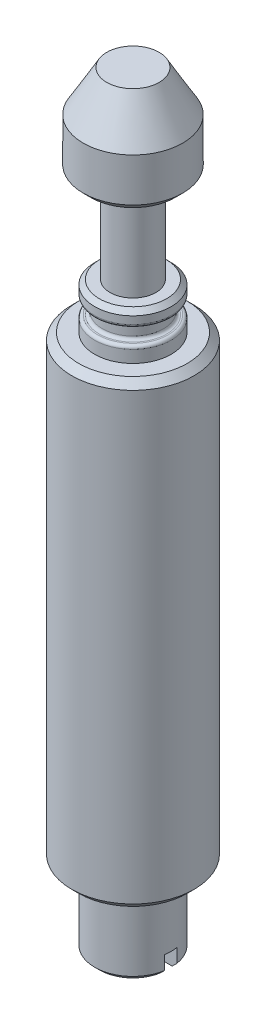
ISO-10303-21;
HEADER;
FILE_DESCRIPTION(('STEP AP214'),'2;1');
FILE_NAME('part.step','',(''),(''),'','','');
FILE_SCHEMA(('AUTOMOTIVE_DESIGN { 1 0 10303 214 1 1 1 1 }'));
ENDSEC;
DATA;
#1=APPLICATION_CONTEXT('core data for automotive mechanical design processes');
#2=APPLICATION_PROTOCOL_DEFINITION('international standard','automotive_design',2000,#1);
#3=PRODUCT_CONTEXT('',#1,'mechanical');
#4=PRODUCT('Part','Part','',(#3));
#5=PRODUCT_RELATED_PRODUCT_CATEGORY('part','',(#4));
#6=PRODUCT_DEFINITION_FORMATION('','',#4);
#7=PRODUCT_DEFINITION_CONTEXT('part definition',#1,'design');
#8=PRODUCT_DEFINITION('design','',#6,#7);
#9=PRODUCT_DEFINITION_SHAPE('','',#8);
#10=(LENGTH_UNIT() NAMED_UNIT(*) SI_UNIT(.MILLI.,.METRE.));
#11=(NAMED_UNIT(*) PLANE_ANGLE_UNIT() SI_UNIT($,.RADIAN.));
#12=(NAMED_UNIT(*) SI_UNIT($,.STERADIAN.) SOLID_ANGLE_UNIT());
#13=UNCERTAINTY_MEASURE_WITH_UNIT(LENGTH_MEASURE(1.E-05),#10,'distance_accuracy_value','');
#14=(GEOMETRIC_REPRESENTATION_CONTEXT(3) GLOBAL_UNCERTAINTY_ASSIGNED_CONTEXT((#13)) GLOBAL_UNIT_ASSIGNED_CONTEXT((#10,
#11,#12)) REPRESENTATION_CONTEXT('',''));
#15=CARTESIAN_POINT('',(0.,0.,0.));
#16=DIRECTION('',(0.,0.,1.));
#17=DIRECTION('',(1.,0.,0.));
#18=AXIS2_PLACEMENT_3D('',#15,#16,#17);
#19=CARTESIAN_POINT('',(0.,50.,0.));
#20=DIRECTION('',(0.,-1.,0.));
#21=DIRECTION('',(0.,0.,-1.));
#22=AXIS2_PLACEMENT_3D('',#19,#20,#21);
#23=PLANE('',#22);
#24=CARTESIAN_POINT('',(0.,49.9999999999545,0.));
#25=DIRECTION('',(0.,-1.,0.));
#26=DIRECTION('',(0.,0.,-1.));
#27=AXIS2_PLACEMENT_3D('',#24,#25,#26);
#28=CIRCLE('',#27,1.71039929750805);
#29=CARTESIAN_POINT('',(0.,49.9999999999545,-1.71039929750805));
#30=VERTEX_POINT('',#29);
#31=EDGE_CURVE('E508',#30,#30,#28,.T.);
#32=ORIENTED_EDGE('',*,*,#31,.F.);
#33=EDGE_LOOP('',(#32));
#34=FACE_BOUND('',#33,.T.);
#35=ADVANCED_FACE('F17',(#34),#23,.F.);
#36=CARTESIAN_POINT('',(0.,47.3333333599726,0.));
#37=DIRECTION('',(0.,-1.,0.));
#38=DIRECTION('',(0.,0.,-1.));
#39=AXIS2_PLACEMENT_3D('',#36,#37,#38);
#40=CONICAL_SURFACE('',#39,3.24999999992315,0.523598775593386);
#41=CARTESIAN_POINT('',(0.,47.33333336,0.));
#42=DIRECTION('',(0.,1.,0.));
#43=DIRECTION('',(0.,0.,1.));
#44=AXIS2_PLACEMENT_3D('',#41,#42,#43);
#45=CIRCLE('',#44,3.25);
#46=CARTESIAN_POINT('',(0.,47.33333336,3.25));
#47=VERTEX_POINT('',#46);
#48=EDGE_CURVE('E511',#47,#47,#45,.F.);
#49=ORIENTED_EDGE('',*,*,#48,.F.);
#50=EDGE_LOOP('',(#49));
#51=FACE_BOUND('',#50,.T.);
#52=ORIENTED_EDGE('',*,*,#31,.T.);
#53=EDGE_LOOP('',(#52));
#54=FACE_BOUND('',#53,.T.);
#55=ADVANCED_FACE('F1092',(#51,#54),#40,.T.);
#56=CARTESIAN_POINT('',(0.,0.,0.));
#57=DIRECTION('',(0.,1.,0.));
#58=DIRECTION('',(0.,0.,1.));
#59=AXIS2_PLACEMENT_3D('',#56,#57,#58);
#60=CYLINDRICAL_SURFACE('',#59,3.25);
#61=ORIENTED_EDGE('',*,*,#48,.T.);
#62=EDGE_LOOP('',(#61));
#63=FACE_BOUND('',#62,.T.);
#64=CARTESIAN_POINT('',(0.,44.4999999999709,0.));
#65=DIRECTION('',(0.,1.,0.));
#66=DIRECTION('',(0.,0.,1.));
#67=AXIS2_PLACEMENT_3D('',#64,#65,#66);
#68=CIRCLE('',#67,3.25000000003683);
#69=CARTESIAN_POINT('',(0.,44.4999999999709,3.25000000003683));
#70=VERTEX_POINT('',#69);
#71=EDGE_CURVE('E507',#70,#70,#68,.F.);
#72=ORIENTED_EDGE('',*,*,#71,.F.);
#73=EDGE_LOOP('',(#72));
#74=FACE_BOUND('',#73,.T.);
#75=ADVANCED_FACE('F1089',(#63,#74),#60,.T.);
#76=CARTESIAN_POINT('',(0.,44.4999999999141,0.));
#77=DIRECTION('',(0.,1.,0.));
#78=DIRECTION('',(0.,0.,1.));
#79=AXIS2_PLACEMENT_3D('',#76,#77,#78);
#80=CONICAL_SURFACE('',#79,3.24999999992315,0.785398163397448);
#81=ORIENTED_EDGE('',*,*,#71,.T.);
#82=EDGE_LOOP('',(#81));
#83=FACE_BOUND('',#82,.T.);
#84=CARTESIAN_POINT('',(0.,43.9999999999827,0.));
#85=DIRECTION('',(0.,1.,0.));
#86=DIRECTION('',(0.,0.,1.));
#87=AXIS2_PLACEMENT_3D('',#84,#85,#86);
#88=CIRCLE('',#87,2.74999999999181);
#89=CARTESIAN_POINT('',(0.,43.9999999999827,2.74999999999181));
#90=VERTEX_POINT('',#89);
#91=EDGE_CURVE('E504',#90,#90,#88,.T.);
#92=ORIENTED_EDGE('',*,*,#91,.T.);
#93=EDGE_LOOP('',(#92));
#94=FACE_BOUND('',#93,.T.);
#95=ADVANCED_FACE('F1085',(#83,#94),#80,.T.);
#96=CARTESIAN_POINT('',(2.75,44.,0.));
#97=DIRECTION('',(0.,1.,0.));
#98=DIRECTION('',(0.,0.,1.));
#99=AXIS2_PLACEMENT_3D('',#96,#97,#98);
#100=PLANE('',#99);
#101=CARTESIAN_POINT('',(0.,44.,0.));
#102=DIRECTION('',(0.,1.,0.));
#103=DIRECTION('',(0.,0.,1.));
#104=AXIS2_PLACEMENT_3D('',#101,#102,#103);
#105=CIRCLE('',#104,1.5);
#106=CARTESIAN_POINT('',(0.,44.,1.5));
#107=VERTEX_POINT('',#106);
#108=EDGE_CURVE('E501',#107,#107,#105,.F.);
#109=ORIENTED_EDGE('',*,*,#108,.F.);
#110=EDGE_LOOP('',(#109));
#111=FACE_BOUND('',#110,.T.);
#112=ORIENTED_EDGE('',*,*,#91,.F.);
#113=EDGE_LOOP('',(#112));
#114=FACE_BOUND('',#113,.T.);
#115=ADVANCED_FACE('F812',(#111,#114),#100,.F.);
#116=CARTESIAN_POINT('',(0.,0.,0.));
#117=DIRECTION('',(0.,1.,0.));
#118=DIRECTION('',(0.,0.,1.));
#119=AXIS2_PLACEMENT_3D('',#116,#117,#118);
#120=CYLINDRICAL_SURFACE('',#119,1.5);
#121=ORIENTED_EDGE('',*,*,#108,.T.);
#122=EDGE_LOOP('',(#121));
#123=FACE_BOUND('',#122,.T.);
#124=CARTESIAN_POINT('',(0.,38.,0.));
#125=DIRECTION('',(0.,1.,0.));
#126=DIRECTION('',(0.,0.,1.));
#127=AXIS2_PLACEMENT_3D('',#124,#125,#126);
#128=CIRCLE('',#127,1.5);
#129=CARTESIAN_POINT('',(0.,38.,1.5));
#130=VERTEX_POINT('',#129);
#131=EDGE_CURVE('E498',#130,#130,#128,.T.);
#132=ORIENTED_EDGE('',*,*,#131,.T.);
#133=EDGE_LOOP('',(#132));
#134=FACE_BOUND('',#133,.T.);
#135=ADVANCED_FACE('F806',(#123,#134),#120,.T.);
#136=CARTESIAN_POINT('',(1.5,38.,0.));
#137=DIRECTION('',(0.,-1.,0.));
#138=DIRECTION('',(0.,0.,-1.));
#139=AXIS2_PLACEMENT_3D('',#136,#137,#138);
#140=PLANE('',#139);
#141=CARTESIAN_POINT('',(0.,38.0000000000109,0.));
#142=DIRECTION('',(0.,-1.,0.));
#143=DIRECTION('',(0.,0.,-1.));
#144=AXIS2_PLACEMENT_3D('',#141,#142,#143);
#145=CIRCLE('',#144,2.20000000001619);
#146=CARTESIAN_POINT('',(0.,38.0000000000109,-2.20000000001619));
#147=VERTEX_POINT('',#146);
#148=EDGE_CURVE('E494',#147,#147,#145,.T.);
#149=ORIENTED_EDGE('',*,*,#148,.F.);
#150=EDGE_LOOP('',(#149));
#151=FACE_BOUND('',#150,.T.);
#152=ORIENTED_EDGE('',*,*,#131,.F.);
#153=EDGE_LOOP('',(#152));
#154=FACE_BOUND('',#153,.T.);
#155=ADVANCED_FACE('F811',(#151,#154),#140,.F.);
#156=CARTESIAN_POINT('',(0.,37.7000000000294,0.));
#157=DIRECTION('',(0.,-1.,0.));
#158=DIRECTION('',(0.,0.,-1.));
#159=AXIS2_PLACEMENT_3D('',#156,#157,#158);
#160=CONICAL_SURFACE('',#159,2.49999999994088,0.785398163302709);
#161=CARTESIAN_POINT('',(0.,37.7,0.));
#162=DIRECTION('',(0.,1.,0.));
#163=DIRECTION('',(0.,0.,1.));
#164=AXIS2_PLACEMENT_3D('',#161,#162,#163);
#165=CIRCLE('',#164,2.5);
#166=CARTESIAN_POINT('',(0.,37.7,2.5));
#167=VERTEX_POINT('',#166);
#168=EDGE_CURVE('E497',#167,#167,#165,.F.);
#169=ORIENTED_EDGE('',*,*,#168,.F.);
#170=EDGE_LOOP('',(#169));
#171=FACE_BOUND('',#170,.T.);
#172=ORIENTED_EDGE('',*,*,#148,.T.);
#173=EDGE_LOOP('',(#172));
#174=FACE_BOUND('',#173,.T.);
#175=ADVANCED_FACE('F854',(#171,#174),#160,.T.);
#176=CARTESIAN_POINT('',(0.,2.5,0.));
#177=DIRECTION('',(0.,1.,0.));
#178=DIRECTION('',(0.,0.,1.));
#179=AXIS2_PLACEMENT_3D('',#176,#177,#178);
#180=PLANE('',#179);
#181=DIRECTION('',(0.866025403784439,0.,-0.5));
#182=VECTOR('',#181,1.);
#183=CARTESIAN_POINT('',(0.,2.5,-0.75));
#184=LINE('',#183,#182);
#185=CARTESIAN_POINT('',(0.,2.5,-0.75));
#186=VERTEX_POINT('',#185);
#187=CARTESIAN_POINT('',(-0.649519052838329,2.5,-0.375));
#188=VERTEX_POINT('',#187);
#189=EDGE_CURVE('E654',#186,#188,#184,.F.);
#190=ORIENTED_EDGE('',*,*,#189,.F.);
#191=DIRECTION('',(0.866025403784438,0.,0.5));
#192=VECTOR('',#191,1.);
#193=CARTESIAN_POINT('',(0.64951905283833,2.5,-0.374999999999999));
#194=LINE('',#193,#192);
#195=CARTESIAN_POINT('',(0.649519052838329,2.5,-0.375));
#196=VERTEX_POINT('',#195);
#197=EDGE_CURVE('E644',#196,#186,#194,.F.);
#198=ORIENTED_EDGE('',*,*,#197,.F.);
#199=DIRECTION('',(0.,0.,1.));
#200=VECTOR('',#199,1.);
#201=CARTESIAN_POINT('',(0.649519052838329,2.5,0.375));
#202=LINE('',#201,#200);
#203=CARTESIAN_POINT('',(0.649519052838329,2.5,0.375));
#204=VERTEX_POINT('',#203);
#205=EDGE_CURVE('E672',#204,#196,#202,.F.);
#206=ORIENTED_EDGE('',*,*,#205,.F.);
#207=DIRECTION('',(-0.866025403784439,0.,0.5));
#208=VECTOR('',#207,1.);
#209=CARTESIAN_POINT('',(0.,2.5,0.75));
#210=LINE('',#209,#208);
#211=CARTESIAN_POINT('',(0.,2.5,0.75));
#212=VERTEX_POINT('',#211);
#213=EDGE_CURVE('E669',#212,#204,#210,.F.);
#214=ORIENTED_EDGE('',*,*,#213,.F.);
#215=DIRECTION('',(-0.866025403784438,0.,-0.5));
#216=VECTOR('',#215,1.);
#217=CARTESIAN_POINT('',(-0.64951905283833,2.5,0.374999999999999));
#218=LINE('',#217,#216);
#219=CARTESIAN_POINT('',(-0.649519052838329,2.5,0.374999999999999));
#220=VERTEX_POINT('',#219);
#221=EDGE_CURVE('E664',#220,#212,#218,.F.);
#222=ORIENTED_EDGE('',*,*,#221,.F.);
#223=DIRECTION('',(0.,0.,-1.));
#224=VECTOR('',#223,1.);
#225=CARTESIAN_POINT('',(-0.649519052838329,2.5,-0.375));
#226=LINE('',#225,#224);
#227=EDGE_CURVE('E659',#188,#220,#226,.F.);
#228=ORIENTED_EDGE('',*,*,#227,.F.);
#229=EDGE_LOOP('',(#190,#198,#206,#214,#222,#228));
#230=FACE_BOUND('',#229,.T.);
#231=ADVANCED_FACE('F864',(#230),#180,.F.);
#232=CARTESIAN_POINT('',(0.,0.,0.));
#233=DIRECTION('',(0.,1.,0.));
#234=DIRECTION('',(0.,0.,1.));
#235=AXIS2_PLACEMENT_3D('',#232,#233,#234);
#236=CYLINDRICAL_SURFACE('',#235,2.5);
#237=ORIENTED_EDGE('',*,*,#168,.T.);
#238=EDGE_LOOP('',(#237));
#239=FACE_BOUND('',#238,.T.);
#240=CARTESIAN_POINT('',(0.,37.2,0.));
#241=DIRECTION('',(0.,1.,0.));
#242=DIRECTION('',(0.,0.,1.));
#243=AXIS2_PLACEMENT_3D('',#240,#241,#242);
#244=CIRCLE('',#243,2.5);
#245=CARTESIAN_POINT('',(0.,37.2,2.5));
#246=VERTEX_POINT('',#245);
#247=EDGE_CURVE('E645',#246,#246,#244,.F.);
#248=ORIENTED_EDGE('',*,*,#247,.F.);
#249=EDGE_LOOP('',(#248));
#250=FACE_BOUND('',#249,.T.);
#251=ADVANCED_FACE('F874',(#239,#250),#236,.T.);
#252=CARTESIAN_POINT('',(0.64951905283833,2.5,-0.374999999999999));
#253=DIRECTION('',(-0.5,0.,0.866025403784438));
#254=DIRECTION('',(0.866025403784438,0.,0.5));
#255=AXIS2_PLACEMENT_3D('',#252,#253,#254);
#256=PLANE('',#255);
#257=DIRECTION('',(0.,1.,0.));
#258=VECTOR('',#257,1.);
#259=CARTESIAN_POINT('',(0.,2.5,-0.75));
#260=LINE('',#259,#258);
#261=CARTESIAN_POINT('',(0.,1.20000000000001,-0.75));
#262=VERTEX_POINT('',#261);
#263=EDGE_CURVE('E651',#262,#186,#260,.T.);
#264=ORIENTED_EDGE('',*,*,#263,.F.);
#265=DIRECTION('',(-0.866025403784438,0.,-0.5));
#266=VECTOR('',#265,1.);
#267=CARTESIAN_POINT('',(0.64951905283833,1.2,-0.374999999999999));
#268=LINE('',#267,#266);
#269=CARTESIAN_POINT('',(0.649519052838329,1.20000000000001,-0.375));
#270=VERTEX_POINT('',#269);
#271=EDGE_CURVE('E648',#270,#262,#268,.T.);
#272=ORIENTED_EDGE('',*,*,#271,.F.);
#273=DIRECTION('',(0.,1.,0.));
#274=VECTOR('',#273,1.);
#275=CARTESIAN_POINT('',(0.649519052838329,2.5,-0.374999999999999));
#276=LINE('',#275,#274);
#277=EDGE_CURVE('E649',#196,#270,#276,.F.);
#278=ORIENTED_EDGE('',*,*,#277,.F.);
#279=ORIENTED_EDGE('',*,*,#197,.T.);
#280=EDGE_LOOP('',(#264,#272,#278,#279));
#281=FACE_BOUND('',#280,.T.);
#282=ADVANCED_FACE('F884',(#281),#256,.T.);
#283=CARTESIAN_POINT('',(0.,2.5,-0.75));
#284=DIRECTION('',(0.5,0.,0.866025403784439));
#285=DIRECTION('',(0.866025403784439,0.,-0.5));
#286=AXIS2_PLACEMENT_3D('',#283,#284,#285);
#287=PLANE('',#286);
#288=DIRECTION('',(0.,1.,0.));
#289=VECTOR('',#288,1.);
#290=CARTESIAN_POINT('',(-0.649519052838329,2.5,-0.375));
#291=LINE('',#290,#289);
#292=CARTESIAN_POINT('',(-0.649519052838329,1.20000000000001,-0.375));
#293=VERTEX_POINT('',#292);
#294=EDGE_CURVE('E656',#293,#188,#291,.T.);
#295=ORIENTED_EDGE('',*,*,#294,.F.);
#296=DIRECTION('',(-0.866025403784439,0.,0.5));
#297=VECTOR('',#296,1.);
#298=CARTESIAN_POINT('',(0.,1.20000000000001,-0.75));
#299=LINE('',#298,#297);
#300=EDGE_CURVE('E694',#262,#293,#299,.T.);
#301=ORIENTED_EDGE('',*,*,#300,.F.);
#302=ORIENTED_EDGE('',*,*,#263,.T.);
#303=ORIENTED_EDGE('',*,*,#189,.T.);
#304=EDGE_LOOP('',(#295,#301,#302,#303));
#305=FACE_BOUND('',#304,.T.);
#306=ADVANCED_FACE('F894',(#305),#287,.T.);
#307=CARTESIAN_POINT('',(-0.649519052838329,2.5,-0.375));
#308=DIRECTION('',(1.,0.,0.));
#309=DIRECTION('',(0.,0.,-1.));
#310=AXIS2_PLACEMENT_3D('',#307,#308,#309);
#311=PLANE('',#310);
#312=DIRECTION('',(0.,1.,0.));
#313=VECTOR('',#312,1.);
#314=CARTESIAN_POINT('',(-0.64951905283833,2.5,0.374999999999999));
#315=LINE('',#314,#313);
#316=CARTESIAN_POINT('',(-0.649519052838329,1.20000000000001,0.374999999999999));
#317=VERTEX_POINT('',#316);
#318=EDGE_CURVE('E661',#317,#220,#315,.T.);
#319=ORIENTED_EDGE('',*,*,#318,.F.);
#320=DIRECTION('',(0.,0.,1.));
#321=VECTOR('',#320,1.);
#322=CARTESIAN_POINT('',(-0.649519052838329,1.20000000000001,0.));
#323=LINE('',#322,#321);
#324=EDGE_CURVE('E697',#293,#317,#323,.T.);
#325=ORIENTED_EDGE('',*,*,#324,.F.);
#326=ORIENTED_EDGE('',*,*,#294,.T.);
#327=ORIENTED_EDGE('',*,*,#227,.T.);
#328=EDGE_LOOP('',(#319,#325,#326,#327));
#329=FACE_BOUND('',#328,.T.);
#330=ADVANCED_FACE('F904',(#329),#311,.T.);
#331=CARTESIAN_POINT('',(-0.64951905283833,2.5,0.374999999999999));
#332=DIRECTION('',(0.5,0.,-0.866025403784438));
#333=DIRECTION('',(-0.866025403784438,0.,-0.5));
#334=AXIS2_PLACEMENT_3D('',#331,#332,#333);
#335=PLANE('',#334);
#336=DIRECTION('',(0.,1.,0.));
#337=VECTOR('',#336,1.);
#338=CARTESIAN_POINT('',(0.,2.5,0.75));
#339=LINE('',#338,#337);
#340=CARTESIAN_POINT('',(0.,1.2,0.75));
#341=VERTEX_POINT('',#340);
#342=EDGE_CURVE('E666',#341,#212,#339,.T.);
#343=ORIENTED_EDGE('',*,*,#342,.F.);
#344=DIRECTION('',(0.866025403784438,0.,0.5));
#345=VECTOR('',#344,1.);
#346=CARTESIAN_POINT('',(-0.64951905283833,1.20000000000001,0.374999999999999));
#347=LINE('',#346,#345);
#348=EDGE_CURVE('E700',#317,#341,#347,.T.);
#349=ORIENTED_EDGE('',*,*,#348,.F.);
#350=ORIENTED_EDGE('',*,*,#318,.T.);
#351=ORIENTED_EDGE('',*,*,#221,.T.);
#352=EDGE_LOOP('',(#343,#349,#350,#351));
#353=FACE_BOUND('',#352,.T.);
#354=ADVANCED_FACE('F914',(#353),#335,.T.);
#355=CARTESIAN_POINT('',(0.,2.5,0.75));
#356=DIRECTION('',(-0.5,0.,-0.866025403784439));
#357=DIRECTION('',(-0.866025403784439,0.,0.5));
#358=AXIS2_PLACEMENT_3D('',#355,#356,#357);
#359=PLANE('',#358);
#360=DIRECTION('',(0.,1.,0.));
#361=VECTOR('',#360,1.);
#362=CARTESIAN_POINT('',(0.649519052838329,2.5,0.375));
#363=LINE('',#362,#361);
#364=CARTESIAN_POINT('',(0.649519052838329,1.2,0.375));
#365=VERTEX_POINT('',#364);
#366=EDGE_CURVE('E138',#365,#204,#363,.T.);
#367=ORIENTED_EDGE('',*,*,#366,.F.);
#368=DIRECTION('',(0.866025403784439,0.,-0.5));
#369=VECTOR('',#368,1.);
#370=CARTESIAN_POINT('',(0.,1.20000000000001,0.75));
#371=LINE('',#370,#369);
#372=EDGE_CURVE('E703',#341,#365,#371,.T.);
#373=ORIENTED_EDGE('',*,*,#372,.F.);
#374=ORIENTED_EDGE('',*,*,#342,.T.);
#375=ORIENTED_EDGE('',*,*,#213,.T.);
#376=EDGE_LOOP('',(#367,#373,#374,#375));
#377=FACE_BOUND('',#376,.T.);
#378=ADVANCED_FACE('F924',(#377),#359,.T.);
#379=CARTESIAN_POINT('',(0.649519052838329,2.5,0.375));
#380=DIRECTION('',(-1.,0.,0.));
#381=DIRECTION('',(0.,0.,1.));
#382=AXIS2_PLACEMENT_3D('',#379,#380,#381);
#383=PLANE('',#382);
#384=ORIENTED_EDGE('',*,*,#277,.T.);
#385=DIRECTION('',(0.,0.,1.));
#386=VECTOR('',#385,1.);
#387=CARTESIAN_POINT('',(0.649519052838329,1.2,0.));
#388=LINE('',#387,#386);
#389=EDGE_CURVE('E488',#365,#270,#388,.F.);
#390=ORIENTED_EDGE('',*,*,#389,.F.);
#391=ORIENTED_EDGE('',*,*,#366,.T.);
#392=ORIENTED_EDGE('',*,*,#205,.T.);
#393=EDGE_LOOP('',(#384,#390,#391,#392));
#394=FACE_BOUND('',#393,.T.);
#395=ADVANCED_FACE('F686',(#394),#383,.T.);
#396=CARTESIAN_POINT('',(0.,37.2,0.));
#397=DIRECTION('',(0.,1.,0.));
#398=DIRECTION('',(0.,0.,1.));
#399=AXIS2_PLACEMENT_3D('',#396,#397,#398);
#400=TOROIDAL_SURFACE('',#399,2.29999999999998,0.200000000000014);
#401=ORIENTED_EDGE('',*,*,#247,.T.);
#402=EDGE_LOOP('',(#401));
#403=FACE_BOUND('',#402,.T.);
#404=CARTESIAN_POINT('',(0.,37.,0.));
#405=DIRECTION('',(0.,1.,0.));
#406=DIRECTION('',(0.,0.,1.));
#407=AXIS2_PLACEMENT_3D('',#404,#405,#406);
#408=CIRCLE('',#407,2.29999999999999);
#409=CARTESIAN_POINT('',(0.,37.,2.3));
#410=VERTEX_POINT('',#409);
#411=CARTESIAN_POINT('',(0.,37.,-2.3));
#412=VERTEX_POINT('',#411);
#413=EDGE_CURVE('E178',#410,#412,#408,.T.);
#414=ORIENTED_EDGE('',*,*,#413,.T.);
#415=CARTESIAN_POINT('',(0.,37.,0.));
#416=DIRECTION('',(0.,1.,0.));
#417=DIRECTION('',(0.,0.,-1.));
#418=AXIS2_PLACEMENT_3D('',#415,#416,#417);
#419=CIRCLE('',#418,2.29999999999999);
#420=EDGE_CURVE('E182',#412,#410,#419,.T.);
#421=ORIENTED_EDGE('',*,*,#420,.T.);
#422=EDGE_LOOP('',(#414,#421));
#423=FACE_BOUND('',#422,.T.);
#424=ADVANCED_FACE('F181',(#403,#423),#400,.T.);
#425=CARTESIAN_POINT('',(0.,1.20000000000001,0.));
#426=DIRECTION('',(0.,-1.,0.));
#427=DIRECTION('',(1.,0.,0.));
#428=AXIS2_PLACEMENT_3D('',#425,#426,#427);
#429=PLANE('',#428);
#430=CARTESIAN_POINT('',(0.,1.2,0.));
#431=DIRECTION('',(0.,1.,0.));
#432=DIRECTION('',(0.,0.,1.));
#433=AXIS2_PLACEMENT_3D('',#430,#431,#432);
#434=CIRCLE('',#433,2.5);
#435=CARTESIAN_POINT('',(-2.46779253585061,1.20000000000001,0.399999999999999));
#436=VERTEX_POINT('',#435);
#437=CARTESIAN_POINT('',(-2.46779253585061,1.20000000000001,-0.400000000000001));
#438=VERTEX_POINT('',#437);
#439=EDGE_CURVE('E492',#436,#438,#434,.F.);
#440=ORIENTED_EDGE('',*,*,#439,.T.);
#441=DIRECTION('',(1.,0.,0.));
#442=VECTOR('',#441,1.);
#443=CARTESIAN_POINT('',(0.,1.20000000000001,-0.4));
#444=LINE('',#443,#442);
#445=CARTESIAN_POINT('',(-1.44568322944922,1.1999999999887,-0.4));
#446=VERTEX_POINT('',#445);
#447=EDGE_CURVE('E190',#438,#446,#444,.T.);
#448=ORIENTED_EDGE('',*,*,#447,.T.);
#449=CARTESIAN_POINT('',(0.,1.19999999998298,0.));
#450=DIRECTION('',(0.,1.,0.));
#451=DIRECTION('',(-1.,0.,0.));
#452=AXIS2_PLACEMENT_3D('',#449,#450,#451);
#453=CIRCLE('',#452,1.49999999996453);
#454=CARTESIAN_POINT('',(1.44568322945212,1.19999999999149,-0.4));
#455=VERTEX_POINT('',#454);
#456=EDGE_CURVE('E709',#446,#455,#453,.F.);
#457=ORIENTED_EDGE('',*,*,#456,.T.);
#458=DIRECTION('',(1.,0.,0.));
#459=VECTOR('',#458,1.);
#460=CARTESIAN_POINT('',(0.,1.20000000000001,-0.4));
#461=LINE('',#460,#459);
#462=CARTESIAN_POINT('',(2.46779253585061,1.19999999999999,-0.4));
#463=VERTEX_POINT('',#462);
#464=EDGE_CURVE('E484',#455,#463,#461,.T.);
#465=ORIENTED_EDGE('',*,*,#464,.T.);
#466=CARTESIAN_POINT('',(0.,1.2,0.));
#467=DIRECTION('',(0.,1.,0.));
#468=DIRECTION('',(0.,0.,1.));
#469=AXIS2_PLACEMENT_3D('',#466,#467,#468);
#470=CIRCLE('',#469,2.5);
#471=CARTESIAN_POINT('',(2.46779253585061,1.19999999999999,0.400000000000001));
#472=VERTEX_POINT('',#471);
#473=EDGE_CURVE('E128',#463,#472,#470,.F.);
#474=ORIENTED_EDGE('',*,*,#473,.T.);
#475=DIRECTION('',(1.,0.,0.));
#476=VECTOR('',#475,1.);
#477=CARTESIAN_POINT('',(0.,1.20000000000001,0.4));
#478=LINE('',#477,#476);
#479=CARTESIAN_POINT('',(1.44568322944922,1.19999999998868,0.4));
#480=VERTEX_POINT('',#479);
#481=EDGE_CURVE('E481',#472,#480,#478,.F.);
#482=ORIENTED_EDGE('',*,*,#481,.T.);
#483=CARTESIAN_POINT('',(0.,1.19999999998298,0.));
#484=DIRECTION('',(0.,1.,0.));
#485=DIRECTION('',(-1.,0.,0.));
#486=AXIS2_PLACEMENT_3D('',#483,#484,#485);
#487=CIRCLE('',#486,1.49999999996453);
#488=CARTESIAN_POINT('',(-1.44568322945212,1.1999999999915,0.4));
#489=VERTEX_POINT('',#488);
#490=EDGE_CURVE('E291',#480,#489,#487,.F.);
#491=ORIENTED_EDGE('',*,*,#490,.T.);
#492=DIRECTION('',(1.,0.,0.));
#493=VECTOR('',#492,1.);
#494=CARTESIAN_POINT('',(0.,1.20000000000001,0.4));
#495=LINE('',#494,#493);
#496=EDGE_CURVE('E486',#489,#436,#495,.F.);
#497=ORIENTED_EDGE('',*,*,#496,.T.);
#498=EDGE_LOOP('',(#440,#448,#457,#465,#474,#482,#491,#497));
#499=FACE_BOUND('',#498,.T.);
#500=ORIENTED_EDGE('',*,*,#372,.T.);
#501=ORIENTED_EDGE('',*,*,#389,.T.);
#502=ORIENTED_EDGE('',*,*,#271,.T.);
#503=ORIENTED_EDGE('',*,*,#300,.T.);
#504=ORIENTED_EDGE('',*,*,#324,.T.);
#505=ORIENTED_EDGE('',*,*,#348,.T.);
#506=EDGE_LOOP('',(#500,#501,#502,#503,#504,#505));
#507=FACE_BOUND('',#506,.T.);
#508=ADVANCED_FACE('F209',(#499,#507),#429,.T.);
#509=CARTESIAN_POINT('',(2.3,37.,0.));
#510=DIRECTION('',(0.,1.,0.));
#511=DIRECTION('',(0.,0.,1.));
#512=AXIS2_PLACEMENT_3D('',#509,#510,#511);
#513=PLANE('',#512);
#514=CARTESIAN_POINT('',(0.,37.,0.));
#515=DIRECTION('',(0.,-1.,0.));
#516=DIRECTION('',(0.,0.,1.));
#517=AXIS2_PLACEMENT_3D('',#514,#515,#516);
#518=CIRCLE('',#517,2.2);
#519=CARTESIAN_POINT('',(0.,37.,-2.2));
#520=VERTEX_POINT('',#519);
#521=CARTESIAN_POINT('',(0.,37.,2.2));
#522=VERTEX_POINT('',#521);
#523=EDGE_CURVE('E289',#520,#522,#518,.F.);
#524=ORIENTED_EDGE('',*,*,#523,.T.);
#525=CARTESIAN_POINT('',(0.,37.,0.));
#526=DIRECTION('',(0.,-1.,0.));
#527=DIRECTION('',(0.,0.,-1.));
#528=AXIS2_PLACEMENT_3D('',#525,#526,#527);
#529=CIRCLE('',#528,2.2);
#530=EDGE_CURVE('E232',#522,#520,#529,.F.);
#531=ORIENTED_EDGE('',*,*,#530,.T.);
#532=EDGE_LOOP('',(#524,#531));
#533=FACE_BOUND('',#532,.T.);
#534=ORIENTED_EDGE('',*,*,#420,.F.);
#535=ORIENTED_EDGE('',*,*,#413,.F.);
#536=EDGE_LOOP('',(#534,#535));
#537=FACE_BOUND('',#536,.T.);
#538=ADVANCED_FACE('F189',(#533,#537),#513,.F.);
#539=CARTESIAN_POINT('',(0.,1.19999999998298,0.));
#540=DIRECTION('',(0.,1.,0.));
#541=DIRECTION('',(-1.,0.,0.));
#542=AXIS2_PLACEMENT_3D('',#539,#540,#541);
#543=CONICAL_SURFACE('',#542,1.49999999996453,0.785398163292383);
#544=CARTESIAN_POINT('',(-1.16261354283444,0.929499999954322,-0.4));
#545=CARTESIAN_POINT('',(-1.21000407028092,0.974361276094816,-0.4));
#546=CARTESIAN_POINT('',(-1.25728848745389,1.01933359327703,-0.4));
#547=CARTESIAN_POINT('',(-1.35164504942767,1.10950026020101,-0.4));
#548=CARTESIAN_POINT('',(-1.39871719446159,1.15469460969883,-0.4));
#549=CARTESIAN_POINT('',(-1.44568322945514,1.19999999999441,-0.4));
#550=B_SPLINE_CURVE_WITH_KNOTS('',3,(#544,#545,#546,#547,#548,#549),.UNSPECIFIED.,.F.,.F.,(4,2,
4),(0.,0.195767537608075,0.391534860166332),.UNSPECIFIED.);
#551=CARTESIAN_POINT('',(-1.1626135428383,0.929499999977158,-0.4));
#552=VERTEX_POINT('',#551);
#553=EDGE_CURVE('E712',#552,#446,#550,.T.);
#554=ORIENTED_EDGE('',*,*,#553,.F.);
#555=CARTESIAN_POINT('',(0.,0.929499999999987,0.));
#556=DIRECTION('',(0.,1.,0.));
#557=DIRECTION('',(-1.,0.,0.));
#558=AXIS2_PLACEMENT_3D('',#555,#556,#557);
#559=CIRCLE('',#558,1.2295);
#560=CARTESIAN_POINT('',(1.1626135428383,0.929499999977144,-0.4));
#561=VERTEX_POINT('',#560);
#562=EDGE_CURVE('E193',#552,#561,#559,.F.);
#563=ORIENTED_EDGE('',*,*,#562,.T.);
#564=CARTESIAN_POINT('',(1.44568322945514,1.19999999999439,-0.4));
#565=CARTESIAN_POINT('',(1.39871719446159,1.15469460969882,-0.4));
#566=CARTESIAN_POINT('',(1.35164504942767,1.109500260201,-0.4));
#567=CARTESIAN_POINT('',(1.25728848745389,1.01933359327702,-0.4));
#568=CARTESIAN_POINT('',(1.21000407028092,0.974361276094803,-0.4));
#569=CARTESIAN_POINT('',(1.16261354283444,0.929499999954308,-0.4));
#570=B_SPLINE_CURVE_WITH_KNOTS('',3,(#564,#565,#566,#567,#568,#569),.UNSPECIFIED.,.F.,.F.,(4,2,
4),(0.,0.19576732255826,0.391534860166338),.UNSPECIFIED.);
#571=EDGE_CURVE('E185',#455,#561,#570,.T.);
#572=ORIENTED_EDGE('',*,*,#571,.F.);
#573=ORIENTED_EDGE('',*,*,#456,.F.);
#574=EDGE_LOOP('',(#554,#563,#572,#573));
#575=FACE_BOUND('',#574,.T.);
#576=ADVANCED_FACE('F208',(#575),#543,.F.);
#577=CARTESIAN_POINT('',(0.,1.19999999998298,0.));
#578=DIRECTION('',(0.,1.,0.));
#579=DIRECTION('',(-1.,0.,0.));
#580=AXIS2_PLACEMENT_3D('',#577,#578,#579);
#581=CONICAL_SURFACE('',#580,1.49999999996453,0.785398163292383);
#582=ORIENTED_EDGE('',*,*,#490,.F.);
#583=CARTESIAN_POINT('',(1.16261354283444,0.929499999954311,0.4));
#584=CARTESIAN_POINT('',(1.21000407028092,0.974361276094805,0.4));
#585=CARTESIAN_POINT('',(1.25728848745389,1.01933359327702,0.4));
#586=CARTESIAN_POINT('',(1.35164504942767,1.109500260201,0.4));
#587=CARTESIAN_POINT('',(1.39871719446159,1.15469460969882,0.4));
#588=CARTESIAN_POINT('',(1.44568322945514,1.19999999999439,0.4));
#589=B_SPLINE_CURVE_WITH_KNOTS('',3,(#583,#584,#585,#586,#587,#588),.UNSPECIFIED.,.F.,.F.,(4,2,
4),(0.,0.195767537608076,0.391534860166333),.UNSPECIFIED.);
#590=CARTESIAN_POINT('',(1.1626135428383,0.929499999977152,0.4));
#591=VERTEX_POINT('',#590);
#592=EDGE_CURVE('E295',#591,#480,#589,.T.);
#593=ORIENTED_EDGE('',*,*,#592,.F.);
#594=CARTESIAN_POINT('',(0.,0.9295,0.));
#595=DIRECTION('',(0.,1.,0.));
#596=DIRECTION('',(-1.,0.,0.));
#597=AXIS2_PLACEMENT_3D('',#594,#595,#596);
#598=CIRCLE('',#597,1.2295);
#599=CARTESIAN_POINT('',(-1.1626135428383,0.929499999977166,0.4));
#600=VERTEX_POINT('',#599);
#601=EDGE_CURVE('E268',#591,#600,#598,.F.);
#602=ORIENTED_EDGE('',*,*,#601,.T.);
#603=CARTESIAN_POINT('',(-1.44568322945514,1.19999999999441,0.4));
#604=CARTESIAN_POINT('',(-1.39871719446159,1.15469460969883,0.4));
#605=CARTESIAN_POINT('',(-1.35164504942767,1.10950026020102,0.4));
#606=CARTESIAN_POINT('',(-1.25728848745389,1.01933359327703,0.4));
#607=CARTESIAN_POINT('',(-1.21000407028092,0.974361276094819,0.4));
#608=CARTESIAN_POINT('',(-1.16261354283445,0.929499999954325,0.4));
#609=B_SPLINE_CURVE_WITH_KNOTS('',3,(#603,#604,#605,#606,#607,#608),.UNSPECIFIED.,.F.,.F.,(4,2,
4),(0.,0.195767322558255,0.391534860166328),.UNSPECIFIED.);
#610=EDGE_CURVE('E290',#489,#600,#609,.T.);
#611=ORIENTED_EDGE('',*,*,#610,.F.);
#612=EDGE_LOOP('',(#582,#593,#602,#611));
#613=FACE_BOUND('',#612,.T.);
#614=ADVANCED_FACE('F260',(#613),#581,.F.);
#615=CARTESIAN_POINT('',(0.,36.8,0.));
#616=DIRECTION('',(0.,1.,0.));
#617=DIRECTION('',(0.,0.,1.));
#618=AXIS2_PLACEMENT_3D('',#615,#616,#617);
#619=TOROIDAL_SURFACE('',#618,2.2,0.200000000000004);
#620=ORIENTED_EDGE('',*,*,#530,.F.);
#621=ORIENTED_EDGE('',*,*,#523,.F.);
#622=EDGE_LOOP('',(#620,#621));
#623=FACE_BOUND('',#622,.T.);
#624=CARTESIAN_POINT('',(0.,36.8,0.));
#625=DIRECTION('',(0.,1.,0.));
#626=DIRECTION('',(0.,0.,1.));
#627=AXIS2_PLACEMENT_3D('',#624,#625,#626);
#628=CIRCLE('',#627,2.);
#629=CARTESIAN_POINT('',(0.,36.8,2.));
#630=VERTEX_POINT('',#629);
#631=EDGE_CURVE('E266',#630,#630,#628,.F.);
#632=ORIENTED_EDGE('',*,*,#631,.F.);
#633=EDGE_LOOP('',(#632));
#634=FACE_BOUND('',#633,.T.);
#635=ADVANCED_FACE('F249',(#623,#634),#619,.F.);
#636=CARTESIAN_POINT('',(0.,0.,0.));
#637=DIRECTION('',(0.,1.,0.));
#638=DIRECTION('',(-1.,0.,0.));
#639=AXIS2_PLACEMENT_3D('',#636,#637,#638);
#640=CYLINDRICAL_SURFACE('',#639,1.2295);
#641=DIRECTION('',(0.,1.,0.));
#642=VECTOR('',#641,1.);
#643=CARTESIAN_POINT('',(1.16261354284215,0.,-0.4));
#644=LINE('',#643,#642);
#645=CARTESIAN_POINT('',(1.16261354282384,0.270500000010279,-0.4));
#646=VERTEX_POINT('',#645);
#647=EDGE_CURVE('E271',#561,#646,#644,.F.);
#648=ORIENTED_EDGE('',*,*,#647,.F.);
#649=ORIENTED_EDGE('',*,*,#562,.F.);
#650=DIRECTION('',(0.,1.,0.));
#651=VECTOR('',#650,1.);
#652=CARTESIAN_POINT('',(-1.16261354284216,0.,-0.4));
#653=LINE('',#652,#651);
#654=CARTESIAN_POINT('',(-1.16261354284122,0.270500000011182,-0.4));
#655=VERTEX_POINT('',#654);
#656=EDGE_CURVE('E283',#655,#552,#653,.T.);
#657=ORIENTED_EDGE('',*,*,#656,.F.);
#658=CARTESIAN_POINT('',(0.,0.270499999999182,0.));
#659=DIRECTION('',(0.,-1.,0.));
#660=DIRECTION('',(1.,0.,0.));
#661=AXIS2_PLACEMENT_3D('',#658,#659,#660);
#662=CIRCLE('',#661,1.22949999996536);
#663=EDGE_CURVE('E285',#655,#646,#662,.T.);
#664=ORIENTED_EDGE('',*,*,#663,.T.);
#665=EDGE_LOOP('',(#648,#649,#657,#664));
#666=FACE_BOUND('',#665,.T.);
#667=ADVANCED_FACE('F259',(#666),#640,.F.);
#668=CARTESIAN_POINT('',(0.,0.,0.));
#669=DIRECTION('',(0.,1.,0.));
#670=DIRECTION('',(-1.,0.,0.));
#671=AXIS2_PLACEMENT_3D('',#668,#669,#670);
#672=CYLINDRICAL_SURFACE('',#671,1.2295);
#673=CARTESIAN_POINT('',(0.,0.270499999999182,0.));
#674=DIRECTION('',(0.,-1.,0.));
#675=DIRECTION('',(1.,0.,0.));
#676=AXIS2_PLACEMENT_3D('',#673,#674,#675);
#677=CIRCLE('',#676,1.22949999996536);
#678=CARTESIAN_POINT('',(1.16261354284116,0.270500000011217,0.4));
#679=VERTEX_POINT('',#678);
#680=CARTESIAN_POINT('',(-1.16261354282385,0.270500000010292,0.4));
#681=VERTEX_POINT('',#680);
#682=EDGE_CURVE('E562',#679,#681,#677,.T.);
#683=ORIENTED_EDGE('',*,*,#682,.T.);
#684=DIRECTION('',(0.,1.,0.));
#685=VECTOR('',#684,1.);
#686=CARTESIAN_POINT('',(-1.16261354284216,0.,0.4));
#687=LINE('',#686,#685);
#688=EDGE_CURVE('E270',#600,#681,#687,.F.);
#689=ORIENTED_EDGE('',*,*,#688,.F.);
#690=ORIENTED_EDGE('',*,*,#601,.F.);
#691=DIRECTION('',(0.,1.,0.));
#692=VECTOR('',#691,1.);
#693=CARTESIAN_POINT('',(1.16261354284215,0.,0.399999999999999));
#694=LINE('',#693,#692);
#695=EDGE_CURVE('E276',#679,#591,#694,.T.);
#696=ORIENTED_EDGE('',*,*,#695,.F.);
#697=EDGE_LOOP('',(#683,#689,#690,#696));
#698=FACE_BOUND('',#697,.T.);
#699=ADVANCED_FACE('F586',(#698),#672,.F.);
#700=CARTESIAN_POINT('',(0.,0.,0.));
#701=DIRECTION('',(0.,1.,0.));
#702=DIRECTION('',(0.,0.,1.));
#703=AXIS2_PLACEMENT_3D('',#700,#701,#702);
#704=CYLINDRICAL_SURFACE('',#703,2.);
#705=ORIENTED_EDGE('',*,*,#631,.T.);
#706=EDGE_LOOP('',(#705));
#707=FACE_BOUND('',#706,.T.);
#708=CARTESIAN_POINT('',(0.,36.2,0.));
#709=DIRECTION('',(0.,1.,0.));
#710=DIRECTION('',(0.,0.,1.));
#711=AXIS2_PLACEMENT_3D('',#708,#709,#710);
#712=CIRCLE('',#711,2.);
#713=CARTESIAN_POINT('',(0.,36.2,2.));
#714=VERTEX_POINT('',#713);
#715=EDGE_CURVE('E552',#714,#714,#712,.T.);
#716=ORIENTED_EDGE('',*,*,#715,.T.);
#717=EDGE_LOOP('',(#716));
#718=FACE_BOUND('',#717,.T.);
#719=ADVANCED_FACE('F582',(#707,#718),#704,.T.);
#720=CARTESIAN_POINT('',(0.,1.13695719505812E-10,0.));
#721=DIRECTION('',(0.,-1.,0.));
#722=DIRECTION('',(1.,0.,0.));
#723=AXIS2_PLACEMENT_3D('',#720,#721,#722);
#724=CONICAL_SURFACE('',#723,1.49999999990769,0.785398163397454);
#725=CARTESIAN_POINT('',(1.16261354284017,0.27050000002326,-0.4));
#726=CARTESIAN_POINT('',(1.21000407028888,0.22563872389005,-0.4));
#727=CARTESIAN_POINT('',(1.2572884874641,0.180666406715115,-0.4));
#728=CARTESIAN_POINT('',(1.35164504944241,0.0904997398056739,-0.4));
#729=CARTESIAN_POINT('',(1.39871719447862,0.0453053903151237,-0.4));
#730=CARTESIAN_POINT('',(1.44568322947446,2.68042235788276E-11,-0.4));
#731=B_SPLINE_CURVE_WITH_KNOTS('',3,(#725,#726,#727,#728,#729,#730),.UNSPECIFIED.,.F.,.F.,(4,2,
4),(0.,0.195767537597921,0.391534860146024),.UNSPECIFIED.);
#732=CARTESIAN_POINT('',(1.44568322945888,4.18282302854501E-11,-0.4));
#733=VERTEX_POINT('',#732);
#734=EDGE_CURVE('E565',#646,#733,#731,.T.);
#735=ORIENTED_EDGE('',*,*,#734,.F.);
#736=ORIENTED_EDGE('',*,*,#663,.F.);
#737=CARTESIAN_POINT('',(-1.44568322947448,2.68144260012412E-11,-0.4));
#738=CARTESIAN_POINT('',(-1.39871719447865,0.0453053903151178,-0.4));
#739=CARTESIAN_POINT('',(-1.35164504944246,0.0904997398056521,-0.4));
#740=CARTESIAN_POINT('',(-1.25728848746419,0.180666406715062,-0.4));
#741=CARTESIAN_POINT('',(-1.21000407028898,0.225638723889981,-0.4));
#742=CARTESIAN_POINT('',(-1.16261354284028,0.270500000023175,-0.4));
#743=B_SPLINE_CURVE_WITH_KNOTS('',3,(#737,#738,#739,#740,#741,#742),.UNSPECIFIED.,.F.,.F.,(4,2,
4),(0.,0.195767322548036,0.39153486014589),.UNSPECIFIED.);
#744=CARTESIAN_POINT('',(-1.4456832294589,4.18333075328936E-11,-0.4));
#745=VERTEX_POINT('',#744);
#746=EDGE_CURVE('E302',#745,#655,#743,.T.);
#747=ORIENTED_EDGE('',*,*,#746,.F.);
#748=CARTESIAN_POINT('',(0.,5.68523006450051E-11,0.));
#749=DIRECTION('',(0.,-1.,0.));
#750=DIRECTION('',(1.,0.,0.));
#751=AXIS2_PLACEMENT_3D('',#748,#749,#750);
#752=CIRCLE('',#751,1.49999999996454);
#753=EDGE_CURVE('E560',#745,#733,#752,.T.);
#754=ORIENTED_EDGE('',*,*,#753,.T.);
#755=EDGE_LOOP('',(#735,#736,#747,#754));
#756=FACE_BOUND('',#755,.T.);
#757=ADVANCED_FACE('F578',(#756),#724,.F.);
#758=CARTESIAN_POINT('',(0.,1.13695719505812E-10,0.));
#759=DIRECTION('',(0.,-1.,0.));
#760=DIRECTION('',(1.,0.,0.));
#761=AXIS2_PLACEMENT_3D('',#758,#759,#760);
#762=CONICAL_SURFACE('',#761,1.49999999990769,0.785398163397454);
#763=CARTESIAN_POINT('',(0.,5.68525174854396E-11,0.));
#764=DIRECTION('',(0.,-1.,0.));
#765=DIRECTION('',(1.,0.,0.));
#766=AXIS2_PLACEMENT_3D('',#763,#764,#765);
#767=CIRCLE('',#766,1.49999999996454);
#768=CARTESIAN_POINT('',(1.44568322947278,2.84262587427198E-11,0.4));
#769=VERTEX_POINT('',#768);
#770=CARTESIAN_POINT('',(-1.4456832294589,4.1833361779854E-11,0.4));
#771=VERTEX_POINT('',#770);
#772=EDGE_CURVE('E343',#769,#771,#767,.T.);
#773=ORIENTED_EDGE('',*,*,#772,.T.);
#774=CARTESIAN_POINT('',(-1.16261354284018,0.270500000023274,0.4));
#775=CARTESIAN_POINT('',(-1.21000407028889,0.225638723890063,0.4));
#776=CARTESIAN_POINT('',(-1.25728848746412,0.180666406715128,0.4));
#777=CARTESIAN_POINT('',(-1.35164504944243,0.0904997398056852,0.4));
#778=CARTESIAN_POINT('',(-1.39871719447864,0.0453053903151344,0.4));
#779=CARTESIAN_POINT('',(-1.44568322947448,2.68141642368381E-11,0.4));
#780=B_SPLINE_CURVE_WITH_KNOTS('',3,(#774,#775,#776,#777,#778,#779),.UNSPECIFIED.,.F.,.F.,(4,2,
4),(0.,0.195767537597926,0.391534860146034),.UNSPECIFIED.);
#781=EDGE_CURVE('E323',#681,#771,#780,.T.);
#782=ORIENTED_EDGE('',*,*,#781,.F.);
#783=ORIENTED_EDGE('',*,*,#682,.F.);
#784=CARTESIAN_POINT('',(1.44568322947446,2.68044931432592E-11,0.4));
#785=CARTESIAN_POINT('',(1.39871719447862,0.0453053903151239,0.4));
#786=CARTESIAN_POINT('',(1.35164504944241,0.090499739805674,0.4));
#787=CARTESIAN_POINT('',(1.2572884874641,0.180666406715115,0.4));
#788=CARTESIAN_POINT('',(1.21000407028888,0.22563872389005,0.4));
#789=CARTESIAN_POINT('',(1.16261354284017,0.27050000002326,0.4));
#790=B_SPLINE_CURVE_WITH_KNOTS('',3,(#784,#785,#786,#787,#788,#789),.UNSPECIFIED.,.F.,.F.,(4,2,
4),(0.,0.195767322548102,0.391534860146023),.UNSPECIFIED.);
#791=EDGE_CURVE('E561',#769,#679,#790,.T.);
#792=ORIENTED_EDGE('',*,*,#791,.F.);
#793=EDGE_LOOP('',(#773,#782,#783,#792));
#794=FACE_BOUND('',#793,.T.);
#795=ADVANCED_FACE('F539',(#794),#762,.F.);
#796=CARTESIAN_POINT('',(0.,36.2,0.));
#797=DIRECTION('',(0.,1.,0.));
#798=DIRECTION('',(0.,0.,1.));
#799=AXIS2_PLACEMENT_3D('',#796,#797,#798);
#800=TOROIDAL_SURFACE('',#799,2.20000000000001,0.200000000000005);
#801=ORIENTED_EDGE('',*,*,#715,.F.);
#802=EDGE_LOOP('',(#801));
#803=FACE_BOUND('',#802,.T.);
#804=CARTESIAN_POINT('',(0.,36.,0.));
#805=DIRECTION('',(0.,1.,0.));
#806=DIRECTION('',(0.,0.,-1.));
#807=AXIS2_PLACEMENT_3D('',#804,#805,#806);
#808=CIRCLE('',#807,2.2);
#809=CARTESIAN_POINT('',(0.,36.,-2.2));
#810=VERTEX_POINT('',#809);
#811=CARTESIAN_POINT('',(0.,36.,2.2));
#812=VERTEX_POINT('',#811);
#813=EDGE_CURVE('E394',#810,#812,#808,.T.);
#814=ORIENTED_EDGE('',*,*,#813,.T.);
#815=CARTESIAN_POINT('',(0.,36.,0.));
#816=DIRECTION('',(0.,1.,0.));
#817=DIRECTION('',(0.,0.,1.));
#818=AXIS2_PLACEMENT_3D('',#815,#816,#817);
#819=CIRCLE('',#818,2.2);
#820=EDGE_CURVE('E548',#812,#810,#819,.T.);
#821=ORIENTED_EDGE('',*,*,#820,.T.);
#822=EDGE_LOOP('',(#814,#821));
#823=FACE_BOUND('',#822,.T.);
#824=ADVANCED_FACE('F529',(#803,#823),#800,.F.);
#825=CARTESIAN_POINT('',(2.2,0.,0.));
#826=DIRECTION('',(0.,1.,0.));
#827=DIRECTION('',(0.,0.,1.));
#828=AXIS2_PLACEMENT_3D('',#825,#826,#827);
#829=PLANE('',#828);
#830=CARTESIAN_POINT('',(0.,-5.68437983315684E-11,0.));
#831=DIRECTION('',(0.,1.,0.));
#832=DIRECTION('',(0.,0.,1.));
#833=AXIS2_PLACEMENT_3D('',#830,#831,#832);
#834=CIRCLE('',#833,2.20000000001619);
#835=CARTESIAN_POINT('',(2.16333076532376,-2.84218991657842E-11,-0.4));
#836=VERTEX_POINT('',#835);
#837=CARTESIAN_POINT('',(-2.16333076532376,-2.84218991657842E-11,-0.4));
#838=VERTEX_POINT('',#837);
#839=EDGE_CURVE('E365',#836,#838,#834,.T.);
#840=ORIENTED_EDGE('',*,*,#839,.F.);
#841=DIRECTION('',(1.,0.,0.));
#842=VECTOR('',#841,1.);
#843=CARTESIAN_POINT('',(2.2,0.,-0.4));
#844=LINE('',#843,#842);
#845=EDGE_CURVE('E728',#733,#836,#844,.T.);
#846=ORIENTED_EDGE('',*,*,#845,.F.);
#847=ORIENTED_EDGE('',*,*,#753,.F.);
#848=DIRECTION('',(1.,0.,0.));
#849=VECTOR('',#848,1.);
#850=CARTESIAN_POINT('',(0.,0.,-0.4));
#851=LINE('',#850,#849);
#852=EDGE_CURVE('E731',#838,#745,#851,.T.);
#853=ORIENTED_EDGE('',*,*,#852,.F.);
#854=EDGE_LOOP('',(#840,#846,#847,#853));
#855=FACE_BOUND('',#854,.T.);
#856=ADVANCED_FACE('F538',(#855),#829,.F.);
#857=CARTESIAN_POINT('',(2.2,0.,0.));
#858=DIRECTION('',(0.,1.,0.));
#859=DIRECTION('',(0.,0.,1.));
#860=AXIS2_PLACEMENT_3D('',#857,#858,#859);
#861=PLANE('',#860);
#862=DIRECTION('',(1.,0.,0.));
#863=VECTOR('',#862,1.);
#864=CARTESIAN_POINT('',(0.,0.,0.4));
#865=LINE('',#864,#863);
#866=CARTESIAN_POINT('',(-2.16333076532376,-2.8421709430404E-11,0.4));
#867=VERTEX_POINT('',#866);
#868=EDGE_CURVE('E338',#867,#771,#865,.T.);
#869=ORIENTED_EDGE('',*,*,#868,.T.);
#870=ORIENTED_EDGE('',*,*,#772,.F.);
#871=DIRECTION('',(1.,0.,0.));
#872=VECTOR('',#871,1.);
#873=CARTESIAN_POINT('',(2.2,0.,0.4));
#874=LINE('',#873,#872);
#875=CARTESIAN_POINT('',(2.16333076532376,-2.8421709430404E-11,0.4));
#876=VERTEX_POINT('',#875);
#877=EDGE_CURVE('E729',#876,#769,#874,.F.);
#878=ORIENTED_EDGE('',*,*,#877,.F.);
#879=CARTESIAN_POINT('',(0.,-5.6843418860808E-11,0.));
#880=DIRECTION('',(0.,1.,0.));
#881=DIRECTION('',(0.,0.,1.));
#882=AXIS2_PLACEMENT_3D('',#879,#880,#881);
#883=CIRCLE('',#882,2.20000000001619);
#884=EDGE_CURVE('E360',#867,#876,#883,.T.);
#885=ORIENTED_EDGE('',*,*,#884,.F.);
#886=EDGE_LOOP('',(#869,#870,#878,#885));
#887=FACE_BOUND('',#886,.T.);
#888=ADVANCED_FACE('F408',(#887),#861,.F.);
#889=CARTESIAN_POINT('',(2.2,36.,0.));
#890=DIRECTION('',(0.,-1.,0.));
#891=DIRECTION('',(0.,0.,-1.));
#892=AXIS2_PLACEMENT_3D('',#889,#890,#891);
#893=PLANE('',#892);
#894=CARTESIAN_POINT('',(0.,36.,0.));
#895=DIRECTION('',(0.,-1.,0.));
#896=DIRECTION('',(0.,0.,1.));
#897=AXIS2_PLACEMENT_3D('',#894,#895,#896);
#898=CIRCLE('',#897,2.3);
#899=CARTESIAN_POINT('',(0.,36.,2.3));
#900=VERTEX_POINT('',#899);
#901=CARTESIAN_POINT('',(0.,36.,-2.3));
#902=VERTEX_POINT('',#901);
#903=EDGE_CURVE('E386',#900,#902,#898,.T.);
#904=ORIENTED_EDGE('',*,*,#903,.F.);
#905=CARTESIAN_POINT('',(0.,36.,0.));
#906=DIRECTION('',(0.,-1.,0.));
#907=DIRECTION('',(0.,0.,-1.));
#908=AXIS2_PLACEMENT_3D('',#905,#906,#907);
#909=CIRCLE('',#908,2.3);
#910=EDGE_CURVE('E381',#902,#900,#909,.T.);
#911=ORIENTED_EDGE('',*,*,#910,.F.);
#912=EDGE_LOOP('',(#904,#911));
#913=FACE_BOUND('',#912,.T.);
#914=ORIENTED_EDGE('',*,*,#813,.F.);
#915=ORIENTED_EDGE('',*,*,#820,.F.);
#916=EDGE_LOOP('',(#914,#915));
#917=FACE_BOUND('',#916,.T.);
#918=ADVANCED_FACE('F399',(#913,#917),#893,.F.);
#919=CARTESIAN_POINT('',(0.,0.,-0.4));
#920=DIRECTION('',(0.,0.,1.));
#921=DIRECTION('',(1.,0.,0.));
#922=AXIS2_PLACEMENT_3D('',#919,#920,#921);
#923=PLANE('',#922);
#924=ORIENTED_EDGE('',*,*,#553,.T.);
#925=ORIENTED_EDGE('',*,*,#447,.F.);
#926=DIRECTION('',(0.,1.,0.));
#927=VECTOR('',#926,1.);
#928=CARTESIAN_POINT('',(-2.46779253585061,0.,-0.400000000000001));
#929=LINE('',#928,#927);
#930=CARTESIAN_POINT('',(-2.46779253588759,0.299999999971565,-0.400000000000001));
#931=VERTEX_POINT('',#930);
#932=EDGE_CURVE('E377',#931,#438,#929,.T.);
#933=ORIENTED_EDGE('',*,*,#932,.F.);
#934=CARTESIAN_POINT('',(-2.16333076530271,-4.91211728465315E-11,-0.4));
#935=CARTESIAN_POINT('',(-2.21412220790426,0.0499514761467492,-0.4));
#936=CARTESIAN_POINT('',(-2.26488974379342,0.0999272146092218,-0.4));
#937=CARTESIAN_POINT('',(-2.36637700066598,0.199927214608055,-0.4));
#938=CARTESIAN_POINT('',(-2.41709672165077,0.249951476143,-0.4));
#939=CARTESIAN_POINT('',(-2.46779253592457,0.29999999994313,-0.4));
#940=B_SPLINE_CURVE_WITH_KNOTS('',3,(#934,#935,#936,#937,#938,#939),.UNSPECIFIED.,.F.,.F.,(4,2,
4),(0.,0.213715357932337,0.427430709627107),.UNSPECIFIED.);
#941=EDGE_CURVE('E337',#838,#931,#940,.T.);
#942=ORIENTED_EDGE('',*,*,#941,.F.);
#943=ORIENTED_EDGE('',*,*,#852,.T.);
#944=ORIENTED_EDGE('',*,*,#746,.T.);
#945=ORIENTED_EDGE('',*,*,#656,.T.);
#946=EDGE_LOOP('',(#924,#925,#933,#942,#943,#944,#945));
#947=FACE_BOUND('',#946,.T.);
#948=ADVANCED_FACE('F315',(#947),#923,.T.);
#949=CARTESIAN_POINT('',(0.,0.,0.4));
#950=DIRECTION('',(0.,0.,1.));
#951=DIRECTION('',(1.,0.,0.));
#952=AXIS2_PLACEMENT_3D('',#949,#950,#951);
#953=PLANE('',#952);
#954=ORIENTED_EDGE('',*,*,#610,.T.);
#955=ORIENTED_EDGE('',*,*,#688,.T.);
#956=ORIENTED_EDGE('',*,*,#781,.T.);
#957=ORIENTED_EDGE('',*,*,#868,.F.);
#958=CARTESIAN_POINT('',(-2.46779253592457,0.29999999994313,0.4));
#959=CARTESIAN_POINT('',(-2.4170967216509,0.249951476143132,0.4));
#960=CARTESIAN_POINT('',(-2.36637700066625,0.199927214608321,0.4));
#961=CARTESIAN_POINT('',(-2.26488974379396,0.099927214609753,0.4));
#962=CARTESIAN_POINT('',(-2.21412220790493,0.0499514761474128,0.4));
#963=CARTESIAN_POINT('',(-2.16333076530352,-4.83252878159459E-11,0.4));
#964=B_SPLINE_CURVE_WITH_KNOTS('',3,(#958,#959,#960,#961,#962,#963),.UNSPECIFIED.,.F.,.F.,(4,2,
4),(0.,0.213715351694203,0.427430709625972),.UNSPECIFIED.);
#965=CARTESIAN_POINT('',(-2.46779253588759,0.299999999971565,0.399999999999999));
#966=VERTEX_POINT('',#965);
#967=EDGE_CURVE('E330',#966,#867,#964,.T.);
#968=ORIENTED_EDGE('',*,*,#967,.F.);
#969=DIRECTION('',(0.,1.,0.));
#970=VECTOR('',#969,1.);
#971=CARTESIAN_POINT('',(-2.46779253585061,0.,0.399999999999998));
#972=LINE('',#971,#970);
#973=EDGE_CURVE('E380',#436,#966,#972,.F.);
#974=ORIENTED_EDGE('',*,*,#973,.F.);
#975=ORIENTED_EDGE('',*,*,#496,.F.);
#976=EDGE_LOOP('',(#954,#955,#956,#957,#968,#974,#975));
#977=FACE_BOUND('',#976,.T.);
#978=ADVANCED_FACE('F310',(#977),#953,.F.);
#979=CARTESIAN_POINT('',(0.,0.29999999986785,0.));
#980=DIRECTION('',(0.,1.,0.));
#981=DIRECTION('',(0.,0.,1.));
#982=AXIS2_PLACEMENT_3D('',#979,#980,#981);
#983=CONICAL_SURFACE('',#982,2.49999999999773,0.785398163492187);
#984=CARTESIAN_POINT('',(2.16333076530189,-3.20206067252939E-11,-0.399999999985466));
#985=CARTESIAN_POINT('',(2.21412220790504,0.0499514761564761,-0.399999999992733));
#986=CARTESIAN_POINT('',(2.26488974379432,0.0999272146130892,-0.399999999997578));
#987=CARTESIAN_POINT('',(2.36637700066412,0.19992721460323,-0.400000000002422));
#988=CARTESIAN_POINT('',(2.41709672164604,0.249951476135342,-0.400000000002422));
#989=CARTESIAN_POINT('',(2.46779253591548,0.299999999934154,-0.4));
#990=B_SPLINE_CURVE_WITH_KNOTS('',3,(#984,#985,#986,#987,#988,#989),.UNSPECIFIED.,.F.,.F.,(4,2,
4),(0.,0.213715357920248,0.427430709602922),.UNSPECIFIED.);
#991=CARTESIAN_POINT('',(2.46779253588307,0.29999999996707,-0.4));
#992=VERTEX_POINT('',#991);
#993=EDGE_CURVE('E359',#836,#992,#990,.T.);
#994=ORIENTED_EDGE('',*,*,#993,.F.);
#995=ORIENTED_EDGE('',*,*,#839,.T.);
#996=ORIENTED_EDGE('',*,*,#941,.T.);
#997=CARTESIAN_POINT('',(0.,0.299999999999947,0.));
#998=DIRECTION('',(0.,1.,0.));
#999=DIRECTION('',(0.,0.,1.));
#1000=AXIS2_PLACEMENT_3D('',#997,#998,#999);
#1001=CIRCLE('',#1000,2.5);
#1002=EDGE_CURVE('E373',#992,#931,#1001,.T.);
#1003=ORIENTED_EDGE('',*,*,#1002,.F.);
#1004=EDGE_LOOP('',(#994,#995,#996,#1003));
#1005=FACE_BOUND('',#1004,.T.);
#1006=ADVANCED_FACE('F314',(#1005),#983,.T.);
#1007=CARTESIAN_POINT('',(0.,0.29999999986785,0.));
#1008=DIRECTION('',(0.,1.,0.));
#1009=DIRECTION('',(0.,0.,1.));
#1010=AXIS2_PLACEMENT_3D('',#1007,#1008,#1009);
#1011=CONICAL_SURFACE('',#1010,2.49999999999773,0.785398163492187);
#1012=CARTESIAN_POINT('',(2.16333076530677,-4.51314289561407E-11,0.4));
#1013=CARTESIAN_POINT('',(2.21412220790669,0.049951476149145,0.4));
#1014=CARTESIAN_POINT('',(2.26488974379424,0.0999272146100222,0.4));
#1015=CARTESIAN_POINT('',(2.36637700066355,0.199927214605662,0.4));
#1016=CARTESIAN_POINT('',(2.41709672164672,0.249951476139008,0.4));
#1017=CARTESIAN_POINT('',(2.46779253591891,0.299999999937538,0.4));
#1018=B_SPLINE_CURVE_WITH_KNOTS('',3,(#1012,#1013,#1014,#1015,#1016,#1017),.UNSPECIFIED.,.F.,
.F.,(4,2,4),(0.,0.213715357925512,0.427430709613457),.UNSPECIFIED.);
#1019=CARTESIAN_POINT('',(2.46779253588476,0.299999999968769,0.400000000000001));
#1020=VERTEX_POINT('',#1019);
#1021=EDGE_CURVE('E37',#876,#1020,#1018,.T.);
#1022=ORIENTED_EDGE('',*,*,#1021,.T.);
#1023=CARTESIAN_POINT('',(0.,0.3,0.));
#1024=DIRECTION('',(0.,1.,0.));
#1025=DIRECTION('',(0.,0.,1.));
#1026=AXIS2_PLACEMENT_3D('',#1023,#1024,#1025);
#1027=CIRCLE('',#1026,2.5);
#1028=EDGE_CURVE('E466',#966,#1020,#1027,.T.);
#1029=ORIENTED_EDGE('',*,*,#1028,.F.);
#1030=ORIENTED_EDGE('',*,*,#967,.T.);
#1031=ORIENTED_EDGE('',*,*,#884,.T.);
#1032=EDGE_LOOP('',(#1022,#1029,#1030,#1031));
#1033=FACE_BOUND('',#1032,.T.);
#1034=ADVANCED_FACE('F345',(#1033),#1011,.T.);
#1035=CARTESIAN_POINT('',(0.,0.,0.4));
#1036=DIRECTION('',(0.,0.,1.));
#1037=DIRECTION('',(1.,0.,0.));
#1038=AXIS2_PLACEMENT_3D('',#1035,#1036,#1037);
#1039=PLANE('',#1038);
#1040=ORIENTED_EDGE('',*,*,#877,.T.);
#1041=ORIENTED_EDGE('',*,*,#791,.T.);
#1042=ORIENTED_EDGE('',*,*,#695,.T.);
#1043=ORIENTED_EDGE('',*,*,#592,.T.);
#1044=ORIENTED_EDGE('',*,*,#481,.F.);
#1045=DIRECTION('',(0.,1.,0.));
#1046=VECTOR('',#1045,1.);
#1047=CARTESIAN_POINT('',(2.46779253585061,0.,0.400000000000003));
#1048=LINE('',#1047,#1046);
#1049=EDGE_CURVE('E444',#1020,#472,#1048,.T.);
#1050=ORIENTED_EDGE('',*,*,#1049,.F.);
#1051=ORIENTED_EDGE('',*,*,#1021,.F.);
#1052=EDGE_LOOP('',(#1040,#1041,#1042,#1043,#1044,#1050,#1051));
#1053=FACE_BOUND('',#1052,.T.);
#1054=ADVANCED_FACE('F349',(#1053),#1039,.F.);
#1055=CARTESIAN_POINT('',(0.,0.,-0.4));
#1056=DIRECTION('',(0.,0.,1.));
#1057=DIRECTION('',(1.,0.,0.));
#1058=AXIS2_PLACEMENT_3D('',#1055,#1056,#1057);
#1059=PLANE('',#1058);
#1060=ORIENTED_EDGE('',*,*,#845,.T.);
#1061=ORIENTED_EDGE('',*,*,#993,.T.);
#1062=DIRECTION('',(0.,1.,0.));
#1063=VECTOR('',#1062,1.);
#1064=CARTESIAN_POINT('',(2.46779253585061,0.,-0.4));
#1065=LINE('',#1064,#1063);
#1066=EDGE_CURVE('E473',#463,#992,#1065,.F.);
#1067=ORIENTED_EDGE('',*,*,#1066,.F.);
#1068=ORIENTED_EDGE('',*,*,#464,.F.);
#1069=ORIENTED_EDGE('',*,*,#571,.T.);
#1070=ORIENTED_EDGE('',*,*,#647,.T.);
#1071=ORIENTED_EDGE('',*,*,#734,.T.);
#1072=EDGE_LOOP('',(#1060,#1061,#1067,#1068,#1069,#1070,#1071));
#1073=FACE_BOUND('',#1072,.T.);
#1074=ADVANCED_FACE('F457',(#1073),#1059,.T.);
#1075=CARTESIAN_POINT('',(0.,35.8,0.));
#1076=DIRECTION('',(0.,1.,0.));
#1077=DIRECTION('',(0.,0.,1.));
#1078=AXIS2_PLACEMENT_3D('',#1075,#1076,#1077);
#1079=TOROIDAL_SURFACE('',#1078,2.29999999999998,0.200000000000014);
#1080=ORIENTED_EDGE('',*,*,#903,.T.);
#1081=ORIENTED_EDGE('',*,*,#910,.T.);
#1082=EDGE_LOOP('',(#1080,#1081));
#1083=FACE_BOUND('',#1082,.T.);
#1084=CARTESIAN_POINT('',(0.,35.8,0.));
#1085=DIRECTION('',(0.,1.,0.));
#1086=DIRECTION('',(0.,0.,1.));
#1087=AXIS2_PLACEMENT_3D('',#1084,#1085,#1086);
#1088=CIRCLE('',#1087,2.5);
#1089=CARTESIAN_POINT('',(0.,35.8,2.5));
#1090=VERTEX_POINT('',#1089);
#1091=EDGE_CURVE('E464',#1090,#1090,#1088,.F.);
#1092=ORIENTED_EDGE('',*,*,#1091,.F.);
#1093=EDGE_LOOP('',(#1092));
#1094=FACE_BOUND('',#1093,.T.);
#1095=ADVANCED_FACE('F446',(#1083,#1094),#1079,.T.);
#1096=CARTESIAN_POINT('',(0.,0.,0.));
#1097=DIRECTION('',(0.,1.,0.));
#1098=DIRECTION('',(0.,0.,1.));
#1099=AXIS2_PLACEMENT_3D('',#1096,#1097,#1098);
#1100=CYLINDRICAL_SURFACE('',#1099,2.5);
#1101=CARTESIAN_POINT('',(0.,5.,0.));
#1102=DIRECTION('',(0.,1.,0.));
#1103=DIRECTION('',(0.,0.,1.));
#1104=AXIS2_PLACEMENT_3D('',#1101,#1102,#1103);
#1105=CIRCLE('',#1104,2.5);
#1106=CARTESIAN_POINT('',(0.,5.,2.5));
#1107=VERTEX_POINT('',#1106);
#1108=EDGE_CURVE('E475',#1107,#1107,#1105,.F.);
#1109=ORIENTED_EDGE('',*,*,#1108,.T.);
#1110=EDGE_LOOP('',(#1109));
#1111=FACE_BOUND('',#1110,.T.);
#1112=ORIENTED_EDGE('',*,*,#473,.F.);
#1113=ORIENTED_EDGE('',*,*,#1066,.T.);
#1114=ORIENTED_EDGE('',*,*,#1002,.T.);
#1115=ORIENTED_EDGE('',*,*,#932,.T.);
#1116=ORIENTED_EDGE('',*,*,#439,.F.);
#1117=ORIENTED_EDGE('',*,*,#973,.T.);
#1118=ORIENTED_EDGE('',*,*,#1028,.T.);
#1119=ORIENTED_EDGE('',*,*,#1049,.T.);
#1120=EDGE_LOOP('',(#1112,#1113,#1114,#1115,#1116,#1117,#1118,#1119));
#1121=FACE_BOUND('',#1120,.T.);
#1122=ADVANCED_FACE('F456',(#1111,#1121),#1100,.T.);
#1123=CARTESIAN_POINT('',(0.,0.,0.));
#1124=DIRECTION('',(0.,1.,0.));
#1125=DIRECTION('',(0.,0.,1.));
#1126=AXIS2_PLACEMENT_3D('',#1123,#1124,#1125);
#1127=CYLINDRICAL_SURFACE('',#1126,2.5);
#1128=ORIENTED_EDGE('',*,*,#1091,.T.);
#1129=EDGE_LOOP('',(#1128));
#1130=FACE_BOUND('',#1129,.T.);
#1131=CARTESIAN_POINT('',(0.,35.,0.));
#1132=DIRECTION('',(0.,1.,0.));
#1133=DIRECTION('',(0.,0.,1.));
#1134=AXIS2_PLACEMENT_3D('',#1131,#1132,#1133);
#1135=CIRCLE('',#1134,2.5);
#1136=CARTESIAN_POINT('',(0.,35.,2.5));
#1137=VERTEX_POINT('',#1136);
#1138=EDGE_CURVE('E627',#1137,#1137,#1135,.T.);
#1139=ORIENTED_EDGE('',*,*,#1138,.T.);
#1140=EDGE_LOOP('',(#1139));
#1141=FACE_BOUND('',#1140,.T.);
#1142=ADVANCED_FACE('F615',(#1130,#1141),#1127,.T.);
#1143=CARTESIAN_POINT('',(3.54,5.,0.));
#1144=DIRECTION('',(0.,1.,0.));
#1145=DIRECTION('',(0.,0.,1.));
#1146=AXIS2_PLACEMENT_3D('',#1143,#1144,#1145);
#1147=PLANE('',#1146);
#1148=ORIENTED_EDGE('',*,*,#1108,.F.);
#1149=EDGE_LOOP('',(#1148));
#1150=FACE_BOUND('',#1149,.T.);
#1151=CARTESIAN_POINT('',(0.,4.99999999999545,0.));
#1152=DIRECTION('',(0.,1.,0.));
#1153=DIRECTION('',(0.,0.,1.));
#1154=AXIS2_PLACEMENT_3D('',#1151,#1152,#1153);
#1155=CIRCLE('',#1154,3.53999999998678);
#1156=CARTESIAN_POINT('',(0.,4.99999999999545,3.53999999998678));
#1157=VERTEX_POINT('',#1156);
#1158=EDGE_CURVE('E629',#1157,#1157,#1155,.T.);
#1159=ORIENTED_EDGE('',*,*,#1158,.F.);
#1160=EDGE_LOOP('',(#1159));
#1161=FACE_BOUND('',#1160,.T.);
#1162=ADVANCED_FACE('F612',(#1150,#1161),#1147,.F.);
#1163=CARTESIAN_POINT('',(2.5,35.,0.));
#1164=DIRECTION('',(0.,-1.,0.));
#1165=DIRECTION('',(0.,0.,-1.));
#1166=AXIS2_PLACEMENT_3D('',#1163,#1164,#1165);
#1167=PLANE('',#1166);
#1168=CARTESIAN_POINT('',(0.,35.000000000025,0.));
#1169=DIRECTION('',(0.,-1.,0.));
#1170=DIRECTION('',(0.,0.,-1.));
#1171=AXIS2_PLACEMENT_3D('',#1168,#1169,#1170);
#1172=CIRCLE('',#1171,3.53999999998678);
#1173=CARTESIAN_POINT('',(0.,35.000000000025,-3.53999999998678));
#1174=VERTEX_POINT('',#1173);
#1175=EDGE_CURVE('E632',#1174,#1174,#1172,.T.);
#1176=ORIENTED_EDGE('',*,*,#1175,.F.);
#1177=EDGE_LOOP('',(#1176));
#1178=FACE_BOUND('',#1177,.T.);
#1179=ORIENTED_EDGE('',*,*,#1138,.F.);
#1180=EDGE_LOOP('',(#1179));
#1181=FACE_BOUND('',#1180,.T.);
#1182=ADVANCED_FACE('F608',(#1178,#1181),#1167,.F.);
#1183=CARTESIAN_POINT('',(0.,5.46000000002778,0.));
#1184=DIRECTION('',(0.,1.,0.));
#1185=DIRECTION('',(0.,0.,1.));
#1186=AXIS2_PLACEMENT_3D('',#1183,#1184,#1185);
#1187=CONICAL_SURFACE('',#1186,3.99999999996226,0.785398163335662);
#1188=CARTESIAN_POINT('',(0.,5.46,0.));
#1189=DIRECTION('',(0.,1.,0.));
#1190=DIRECTION('',(0.,0.,1.));
#1191=AXIS2_PLACEMENT_3D('',#1188,#1189,#1190);
#1192=CIRCLE('',#1191,4.);
#1193=CARTESIAN_POINT('',(0.,5.46,4.));
#1194=VERTEX_POINT('',#1193);
#1195=EDGE_CURVE('E28',#1194,#1194,#1192,.T.);
#1196=ORIENTED_EDGE('',*,*,#1195,.F.);
#1197=EDGE_LOOP('',(#1196));
#1198=FACE_BOUND('',#1197,.T.);
#1199=ORIENTED_EDGE('',*,*,#1158,.T.);
#1200=EDGE_LOOP('',(#1199));
#1201=FACE_BOUND('',#1200,.T.);
#1202=ADVANCED_FACE('F601',(#1198,#1201),#1187,.T.);
#1203=CARTESIAN_POINT('',(0.,34.5400000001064,0.));
#1204=DIRECTION('',(0.,-1.,0.));
#1205=DIRECTION('',(0.,0.,-1.));
#1206=AXIS2_PLACEMENT_3D('',#1203,#1204,#1205);
#1207=CONICAL_SURFACE('',#1206,3.99999999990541,0.785398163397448);
#1208=CARTESIAN_POINT('',(0.,34.54,0.));
#1209=DIRECTION('',(0.,1.,0.));
#1210=DIRECTION('',(0.,0.,1.));
#1211=AXIS2_PLACEMENT_3D('',#1208,#1209,#1210);
#1212=CIRCLE('',#1211,4.);
#1213=CARTESIAN_POINT('',(0.,34.54,4.));
#1214=VERTEX_POINT('',#1213);
#1215=EDGE_CURVE('E11',#1214,#1214,#1212,.F.);
#1216=ORIENTED_EDGE('',*,*,#1215,.F.);
#1217=EDGE_LOOP('',(#1216));
#1218=FACE_BOUND('',#1217,.T.);
#1219=ORIENTED_EDGE('',*,*,#1175,.T.);
#1220=EDGE_LOOP('',(#1219));
#1221=FACE_BOUND('',#1220,.T.);
#1222=ADVANCED_FACE('F595',(#1218,#1221),#1207,.T.);
#1223=CARTESIAN_POINT('',(0.,0.,0.));
#1224=DIRECTION('',(0.,1.,0.));
#1225=DIRECTION('',(0.,0.,1.));
#1226=AXIS2_PLACEMENT_3D('',#1223,#1224,#1225);
#1227=CYLINDRICAL_SURFACE('',#1226,4.);
#1228=ORIENTED_EDGE('',*,*,#1215,.T.);
#1229=EDGE_LOOP('',(#1228));
#1230=FACE_BOUND('',#1229,.T.);
#1231=ORIENTED_EDGE('',*,*,#1195,.T.);
#1232=EDGE_LOOP('',(#1231));
#1233=FACE_BOUND('',#1232,.T.);
#1234=ADVANCED_FACE('F593',(#1230,#1233),#1227,.T.);
#1235=CLOSED_SHELL('',(#35,#55,#75,#95,#115,#135,#155,#175,#231,#251,#282,#306,#330,#354,#378,
#395,#424,#508,#538,#576,#614,#635,#667,#699,#719,#757,#795,#824,#856,#888,#918,#948,#978,#1006,
#1034,#1054,#1074,#1095,#1122,#1142,#1162,#1182,#1202,#1222,#1234));
#1236=MANIFOLD_SOLID_BREP('B1',#1235);
#1237=ADVANCED_BREP_SHAPE_REPRESENTATION('',(#18,#1236),#14);
#1238=SHAPE_DEFINITION_REPRESENTATION(#9,#1237);
ENDSEC;
END-ISO-10303-21;
